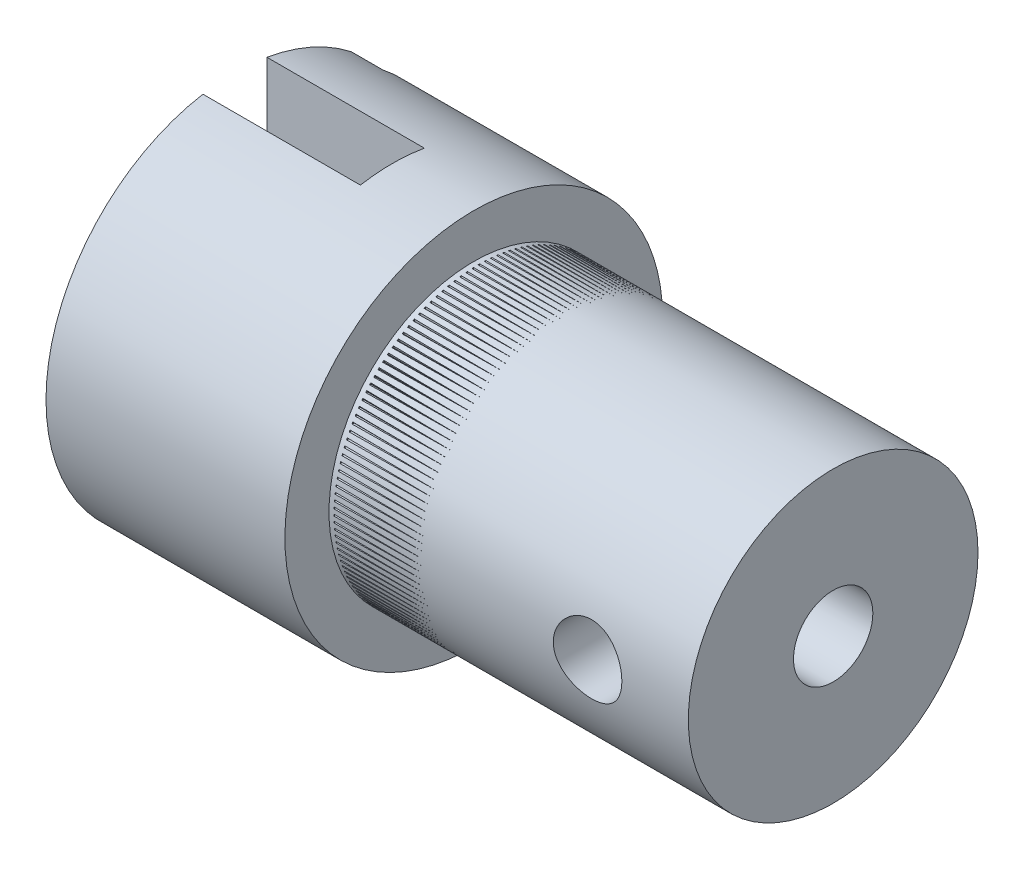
from build123d import *

# Parameters (mm, degrees)
SKETCH1_R                            = 9.525
SKETCH1_R_2                          = 1.5875
EXTRUDE1_DEPTH                       = 30.1625
CUT_EXTRUDE2_START                   = -18.11655
SKETCH5_R                            = 9.525
SKETCH5_R_2                          = 7.3025
CUT_EXTRUDE2_DEPTH                   = 18.11655
SLOT_CUT_DEPTH                       = 34.033735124
SLOT_CUT_DEPTH_BACK                  = 34.033735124
SKETCH6_W                            = 7.9375
SKETCH6_H                            = 3.2258
F_11_32_0_34375_DIAMETER_HOLE1_D     = 8.73125
F_11_32_0_34375_DIAMETER_HOLE1_DEPTH = 11.1125
SKETCH10_W                           = 1.7272
SKETCH10_H                           = 7.3025
SKETCH12_R                           = 2.00025
EXTRUDE2_DEPTH                       = 10.541
CUT_EXTRUDE5_DEPTH                   = 1.5875
KNURL_START                          = 0.254
KNURL_DEPTH                          = 6.35
KNURL_TAPER                          = 0.5
CIRPATTERN1_COUNT                    = 148
FILLET1_R                            = 0.254


with BuildPart() as part:
    # Sketch1 → Extrude1 (new body)
    with BuildSketch(Plane(origin=(0, 0, 0), x_dir=(0, 0, -1), z_dir=(1, 0, 0))):
        Circle(SKETCH1_R)
        Circle(SKETCH1_R_2, mode=Mode.SUBTRACT)
    extrude(amount=EXTRUDE1_DEPTH)

    # Sketch5 → Cut-Extrude2 (cut)
    with BuildSketch(Plane(origin=(30.1625, 0, 0), x_dir=(0, 0, -1), z_dir=(1, 0, 0)).offset(CUT_EXTRUDE2_START)):
        Circle(SKETCH5_R)
        Circle(SKETCH5_R_2, mode=Mode.SUBTRACT)
    extrude(amount=CUT_EXTRUDE2_DEPTH, mode=Mode.SUBTRACT)

    # Sketch6 → Slot Cut (cut, two sides: drawn at the far end of the back side and taken through both)
    with BuildSketch(Plane(origin=(0, 0, 0), x_dir=(1, 0, 0), z_dir=(0, 1, 0)).offset(-SLOT_CUT_DEPTH_BACK)):
        with Locations((3.96875, 0)):
            Rectangle(SKETCH6_W, SKETCH6_H)
    extrude(amount=SLOT_CUT_DEPTH + SLOT_CUT_DEPTH_BACK, mode=Mode.SUBTRACT)

    # 11_32 _0.34375_ Diameter Hole1
    with Locations(Plane.ZY):
        with Locations((0, 0)):
            Hole(F_11_32_0_34375_DIAMETER_HOLE1_D / 2, depth=F_11_32_0_34375_DIAMETER_HOLE1_DEPTH)

    # Sketch10 → 8-32 Tapped Hole1_OLD (revolve, cut)
    with BuildSketch(Plane(origin=(25.0825, 0, 0), x_dir=(0, 0, 1), z_dir=(1, 0, 0))):
        with Locations((0.8636, 3.65125)):
            Rectangle(SKETCH10_W, SKETCH10_H)
    revolve(axis=Axis((25.0825, 6.35, 0), (0, -1, 0)), mode=Mode.SUBTRACT)

    # Sketch21 → 8-32 Tapped Hole2_NEW (revolve, cut)
    with BuildSketch(Plane.YZ.offset(25.0825)):
        Polygon((0, 0), (0, 13.331406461), (1.7272, 12.2936), (1.7272, 0), align=None)
    revolve(axis=Axis((25.0825, 0, -6.35), (0, 0, 1)), mode=Mode.SUBTRACT)

    # Sketch12 → Extrude2 (cut)
    with BuildSketch(Plane(origin=(30.1625, 0, 0), x_dir=(0, 0, -1), z_dir=(1, 0, 0))):
        Circle(SKETCH12_R)
    extrude(amount=-EXTRUDE2_DEPTH, mode=Mode.SUBTRACT)

    # Sketch14 → Cut-Extrude5 (cut)
    with BuildSketch(Plane.ZY):
        with BuildLine():
            Line((-4.642472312, -5.942093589), (-5.864175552, -7.505802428))
            ThreePointArc((-5.864175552, -7.505802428), (-9.525, 0), (-5.864175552, 7.505802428))
            Line((-5.864175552, 7.505802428), (-4.642472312, 5.942093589))
            ThreePointArc((-4.642472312, 5.942093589), (-7.540625, 0), (-4.642472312, -5.942093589))
        make_face()
    extrude(amount=-CUT_EXTRUDE5_DEPTH, mode=Mode.SUBTRACT)

    # Sketch17 → Knurl (cut)
    with BuildSketch(Plane(origin=(12.04595, 0, 0), x_dir=(0, 0, -1), z_dir=(1, 0, 0)).offset(KNURL_START)):
        Polygon((7.1882, 0), (7.710711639, -0.190178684), (7.710711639, 0.190178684), align=None)
    knurl = extrude(amount=KNURL_DEPTH, taper=KNURL_TAPER, mode=Mode.SUBTRACT)

    # CirPattern1: Knurl ×148 about axis
    cirpattern1_axis = Axis((0, 0, 0), (1, 0, 0))
    for i in range(1, CIRPATTERN1_COUNT):
        add(knurl.rotate(cirpattern1_axis, i * 360 / CIRPATTERN1_COUNT), mode=Mode.SUBTRACT)

    # Fillet1
    fillet1_edges = [part.edges().sort_by_distance(p)[0] for p in [
        (0.79375, 5.942093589, -4.642472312),
        (0.79375, -5.942093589, -4.642472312),
    ]]
    fillet(fillet1_edges, radius=FILLET1_R)


solid = part.part
